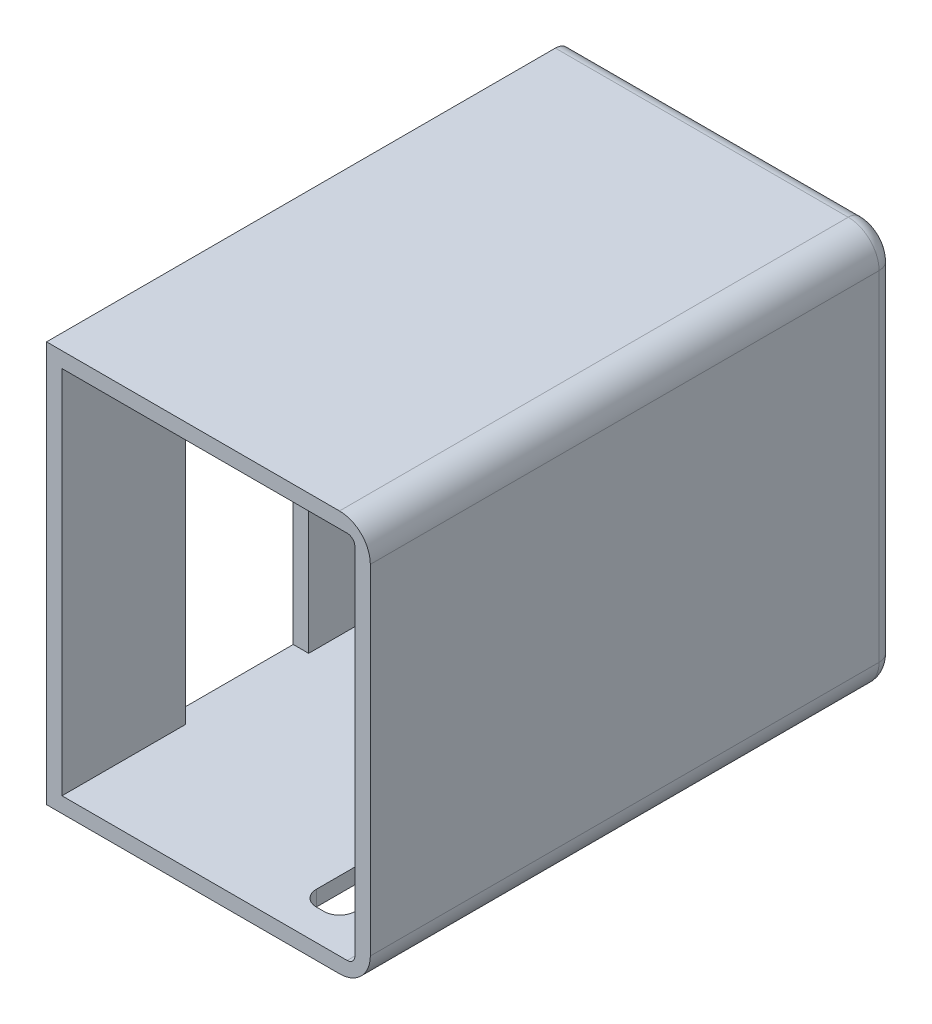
from build123d import *

# Parameters (mm, degrees)
CROQUIS1_W              = 210
CROQUIS1_H              = 260
CROQUIS1_W_2            = 190
CROQUIS1_H_2            = 240
SALIENTE_EXTRUIR2_DEPTH = 330
CROQUIS3_W              = 210
CROQUIS3_H              = 260
SALIENTE_EXTRUIR3_DEPTH = 10
CROQUIS4_W              = 80
CROQUIS4_H              = 240
CORTAR_EXTRUIR2_DEPTH   = 10
CORTAR_EXTRUIR3_DEPTH   = 10
REDONDEO5_R             = 20
REDONDEO6_R             = 20
REDONDEO7_R             = 5
REDONDEO8_R             = 5
REDONDEO9_R             = 10


with BuildPart() as part:
    # Croquis1 → Saliente-Extruir2 (new body)
    with BuildSketch(Plane.XY):
        Rectangle(CROQUIS1_W, CROQUIS1_H)
        Rectangle(CROQUIS1_W_2, CROQUIS1_H_2, mode=Mode.SUBTRACT)
    extrude(amount=SALIENTE_EXTRUIR2_DEPTH)

    # Croquis3 → Saliente-Extruir3 (add)
    with BuildSketch(Plane(origin=(0, 0, 0), x_dir=(-1, 0, 0), z_dir=(0, 0, -1))):
        Rectangle(CROQUIS3_W, CROQUIS3_H)
    extrude(amount=SALIENTE_EXTRUIR3_DEPTH)

    # Croquis4 → Cortar-Extruir2 (cut)
    with BuildSketch(Plane.ZY.offset(105)):
        with Locations((210, 0)):
            Rectangle(CROQUIS4_W, CROQUIS4_H)
        with Locations((50, 0)):
            Rectangle(CROQUIS4_W, CROQUIS4_H)
    extrude(amount=-CORTAR_EXTRUIR2_DEPTH, mode=Mode.SUBTRACT)

    # Croquis5 → Cortar-Extruir3 (cut)
    with BuildSketch(Plane.XZ.offset(130)):
        with BuildLine():
            Line((50, 310), (55, 310))
            ThreePointArc((55, 310), (62.071067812, 307.071067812), (65, 300))
            Line((65, 300), (65, 20))
            ThreePointArc((65, 20), (62.071067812, 12.928932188), (55, 10))
            Line((55, 10), (50, 10))
            ThreePointArc((50, 10), (42.928932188, 12.928932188), (40, 20))
            Line((40, 20), (40, 300))
            ThreePointArc((40, 300), (42.928932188, 307.071067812), (50, 310))
        make_face()
    extrude(amount=-CORTAR_EXTRUIR3_DEPTH, mode=Mode.SUBTRACT)

    # Redondeo5
    redondeo5_edges = [part.edges().sort_by_distance(p)[0] for p in [
        (105, -130, 160),
    ]]
    fillet(redondeo5_edges, radius=REDONDEO5_R)

    # Redondeo6
    redondeo6_edges = [part.edges().sort_by_distance(p)[0] for p in [
        (105, 130, 160),
    ]]
    fillet(redondeo6_edges, radius=REDONDEO6_R)

    # Redondeo7
    redondeo7_edges = [part.edges().sort_by_distance(p)[0] for p in [
        (95, -120, 165),
    ]]
    fillet(redondeo7_edges, radius=REDONDEO7_R)

    # Redondeo8
    redondeo8_edges = [part.edges().sort_by_distance(p)[0] for p in [
        (95, 120, 165),
    ]]
    fillet(redondeo8_edges, radius=REDONDEO8_R)

    # Redondeo9
    redondeo9_edges = [part.edges().sort_by_distance(p)[0] for p in [
        (-10, -130, -10),
        (99.142135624, -124.142135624, -10),
        (105, 0, -10),
        (99.142135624, 124.142135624, -10),
        (-10, 130, -10),
    ]]
    fillet(redondeo9_edges, radius=REDONDEO9_R)


solid = part.part
